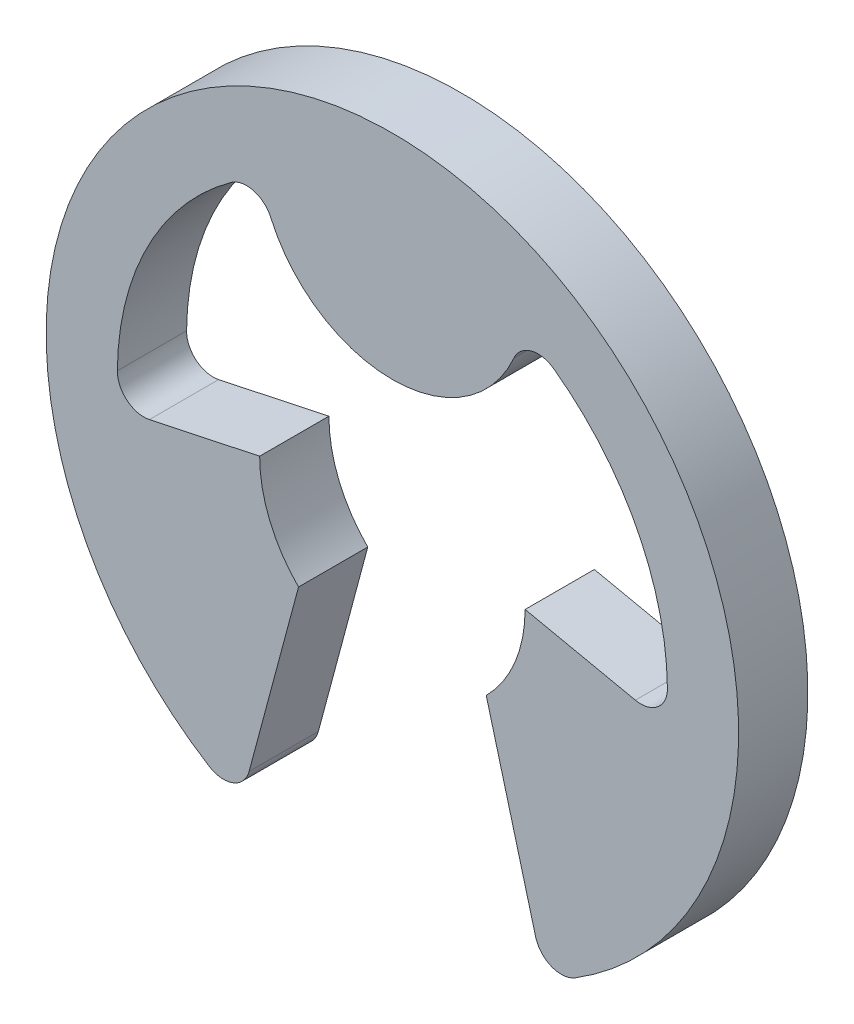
from build123d import *

# Parameters (mm, degrees)
BASE_EXTRUSION_DEPTH = 0.6


with BuildPart() as part:
    # Esquisse1 → Base-Extrusion (new body)
    with BuildSketch(Plane.XY):
        with BuildLine():
            Line((0.813172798, -0.813172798), (1.24139379, -2.411315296))
            ThreePointArc((1.24139379, -2.411315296), (1.379064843, -2.565705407), (1.585079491, -2.547061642))
            ThreePointArc((1.585079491, -2.547061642), (0, 3), (-1.585079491, -2.547061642))
            ThreePointArc((-1.585079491, -2.547061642), (-1.379064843, -2.565705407), (-1.24139379, -2.411315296))
            Line((-1.24139379, -2.411315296), (-0.813172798, -0.813172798))
            ThreePointArc((-0.813172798, -0.813172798), (-1.062461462, -0.440085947), (-1.15, 0))
            Line((-1.15, 0), (-2.105402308, -0.20307703))
            ThreePointArc((-2.105402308, -0.20307703), (-2.298872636, -0.156108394), (-2.383210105, 0.024235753))
            ThreePointArc((-2.383210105, 0.024235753), (-2.11720352, 1.09440716), (-1.39794881, 1.930289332))
            ThreePointArc((-1.39794881, 1.930289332), (-1.202877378, 1.966001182), (-1.052534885, 1.836674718))
            ThreePointArc((-1.052534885, 1.836674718), (0, 1.15), (1.052534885, 1.836674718))
            ThreePointArc((1.052534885, 1.836674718), (1.202877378, 1.966001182), (1.39794881, 1.930289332))
            ThreePointArc((1.39794881, 1.930289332), (2.11720352, 1.09440716), (2.383210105, 0.024235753))
            ThreePointArc((2.383210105, 0.024235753), (2.298872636, -0.156108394), (2.105402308, -0.20307703))
            Line((2.105402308, -0.20307703), (1.15, 0))
            ThreePointArc((1.15, 0), (1.062461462, -0.440085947), (0.813172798, -0.813172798))
        make_face()
    extrude(amount=BASE_EXTRUSION_DEPTH)


solid = part.part
